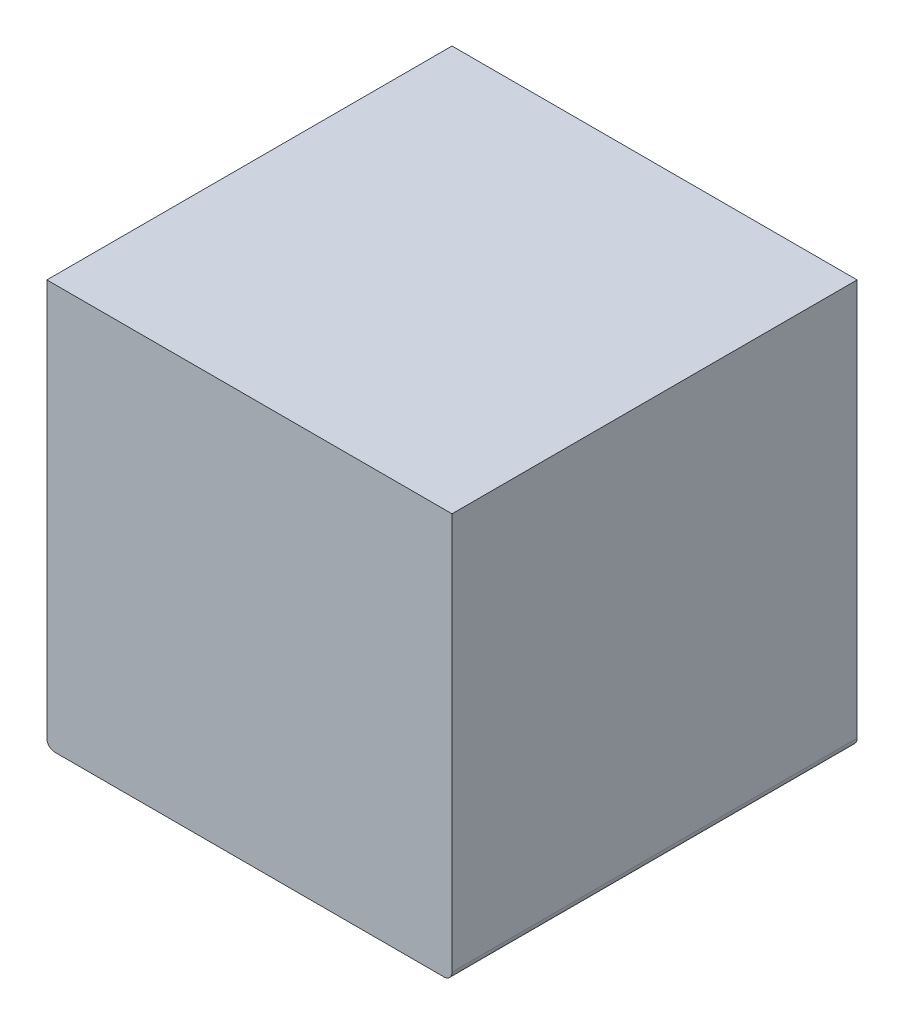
ISO-10303-21;
HEADER;
FILE_DESCRIPTION(('STEP AP214'),'2;1');
FILE_NAME('part.step','',(''),(''),'','','');
FILE_SCHEMA(('AUTOMOTIVE_DESIGN { 1 0 10303 214 1 1 1 1 }'));
ENDSEC;
DATA;
#1=APPLICATION_CONTEXT('core data for automotive mechanical design processes');
#2=APPLICATION_PROTOCOL_DEFINITION('international standard','automotive_design',2000,#1);
#3=PRODUCT_CONTEXT('',#1,'mechanical');
#4=PRODUCT('Part','Part','',(#3));
#5=PRODUCT_RELATED_PRODUCT_CATEGORY('part','',(#4));
#6=PRODUCT_DEFINITION_FORMATION('','',#4);
#7=PRODUCT_DEFINITION_CONTEXT('part definition',#1,'design');
#8=PRODUCT_DEFINITION('design','',#6,#7);
#9=PRODUCT_DEFINITION_SHAPE('','',#8);
#10=(LENGTH_UNIT() NAMED_UNIT(*) SI_UNIT(.MILLI.,.METRE.));
#11=(NAMED_UNIT(*) PLANE_ANGLE_UNIT() SI_UNIT($,.RADIAN.));
#12=(NAMED_UNIT(*) SI_UNIT($,.STERADIAN.) SOLID_ANGLE_UNIT());
#13=UNCERTAINTY_MEASURE_WITH_UNIT(LENGTH_MEASURE(1.E-05),#10,'distance_accuracy_value','');
#14=(GEOMETRIC_REPRESENTATION_CONTEXT(3) GLOBAL_UNCERTAINTY_ASSIGNED_CONTEXT((#13)) GLOBAL_UNIT_ASSIGNED_CONTEXT((#10,
#11,#12)) REPRESENTATION_CONTEXT('',''));
#15=CARTESIAN_POINT('',(0.,0.,0.));
#16=DIRECTION('',(0.,0.,1.));
#17=DIRECTION('',(1.,0.,0.));
#18=AXIS2_PLACEMENT_3D('',#15,#16,#17);
#19=CARTESIAN_POINT('',(-50.,100.,50.));
#20=DIRECTION('',(1.,0.,0.));
#21=DIRECTION('',(0.,0.,-1.));
#22=AXIS2_PLACEMENT_3D('',#19,#20,#21);
#23=PLANE('',#22);
#24=DIRECTION('',(0.,-1.,0.));
#25=VECTOR('',#24,1.);
#26=CARTESIAN_POINT('',(-50.,100.,-50.));
#27=LINE('',#26,#25);
#28=CARTESIAN_POINT('',(-50.,100.,-50.));
#29=VERTEX_POINT('',#28);
#30=CARTESIAN_POINT('',(-50.,2.,-50.));
#31=VERTEX_POINT('',#30);
#32=EDGE_CURVE('E140',#29,#31,#27,.T.);
#33=ORIENTED_EDGE('',*,*,#32,.T.);
#34=DIRECTION('',(0.,0.,1.));
#35=VECTOR('',#34,1.);
#36=CARTESIAN_POINT('',(-50.,2.,50.));
#37=LINE('',#36,#35);
#38=CARTESIAN_POINT('',(-50.,2.,50.));
#39=VERTEX_POINT('',#38);
#40=EDGE_CURVE('E121',#31,#39,#37,.T.);
#41=ORIENTED_EDGE('',*,*,#40,.T.);
#42=DIRECTION('',(0.,-1.,0.));
#43=VECTOR('',#42,1.);
#44=CARTESIAN_POINT('',(-50.,100.,50.));
#45=LINE('',#44,#43);
#46=CARTESIAN_POINT('',(-50.,100.,50.));
#47=VERTEX_POINT('',#46);
#48=EDGE_CURVE('E102',#47,#39,#45,.T.);
#49=ORIENTED_EDGE('',*,*,#48,.F.);
#50=DIRECTION('',(0.,0.,1.));
#51=VECTOR('',#50,1.);
#52=CARTESIAN_POINT('',(-50.,100.,50.));
#53=LINE('',#52,#51);
#54=EDGE_CURVE('E108',#29,#47,#53,.T.);
#55=ORIENTED_EDGE('',*,*,#54,.F.);
#56=EDGE_LOOP('',(#33,#41,#49,#55));
#57=FACE_BOUND('',#56,.T.);
#58=ADVANCED_FACE('F41',(#57),#23,.F.);
#59=CARTESIAN_POINT('',(50.,100.,50.));
#60=DIRECTION('',(0.,0.,-1.));
#61=DIRECTION('',(-1.,0.,0.));
#62=AXIS2_PLACEMENT_3D('',#59,#60,#61);
#63=PLANE('',#62);
#64=ORIENTED_EDGE('',*,*,#48,.T.);
#65=CARTESIAN_POINT('',(-48.,2.,50.));
#66=DIRECTION('',(0.,0.,-1.));
#67=DIRECTION('',(-1.,0.,0.));
#68=AXIS2_PLACEMENT_3D('',#65,#66,#67);
#69=CIRCLE('',#68,2.);
#70=CARTESIAN_POINT('',(-48.,0.,50.));
#71=VERTEX_POINT('',#70);
#72=EDGE_CURVE('E131',#39,#71,#69,.F.);
#73=ORIENTED_EDGE('',*,*,#72,.T.);
#74=DIRECTION('',(1.,0.,0.));
#75=VECTOR('',#74,1.);
#76=CARTESIAN_POINT('',(50.,0.,50.));
#77=LINE('',#76,#75);
#78=CARTESIAN_POINT('',(48.,0.,50.));
#79=VERTEX_POINT('',#78);
#80=EDGE_CURVE('E145',#71,#79,#77,.T.);
#81=ORIENTED_EDGE('',*,*,#80,.T.);
#82=CARTESIAN_POINT('',(48.,2.,50.));
#83=DIRECTION('',(0.,0.,-1.));
#84=DIRECTION('',(-1.,0.,0.));
#85=AXIS2_PLACEMENT_3D('',#82,#83,#84);
#86=CIRCLE('',#85,2.);
#87=CARTESIAN_POINT('',(50.,2.,50.));
#88=VERTEX_POINT('',#87);
#89=EDGE_CURVE('E123',#79,#88,#86,.F.);
#90=ORIENTED_EDGE('',*,*,#89,.T.);
#91=DIRECTION('',(0.,-1.,0.));
#92=VECTOR('',#91,1.);
#93=CARTESIAN_POINT('',(50.,100.,50.));
#94=LINE('',#93,#92);
#95=CARTESIAN_POINT('',(50.,100.,50.));
#96=VERTEX_POINT('',#95);
#97=EDGE_CURVE('E104',#96,#88,#94,.T.);
#98=ORIENTED_EDGE('',*,*,#97,.F.);
#99=DIRECTION('',(1.,0.,0.));
#100=VECTOR('',#99,1.);
#101=CARTESIAN_POINT('',(50.,100.,50.));
#102=LINE('',#101,#100);
#103=EDGE_CURVE('E98',#47,#96,#102,.T.);
#104=ORIENTED_EDGE('',*,*,#103,.F.);
#105=EDGE_LOOP('',(#64,#73,#81,#90,#98,#104));
#106=FACE_BOUND('',#105,.T.);
#107=ADVANCED_FACE('F100',(#106),#63,.F.);
#108=CARTESIAN_POINT('',(50.,100.,50.));
#109=DIRECTION('',(-1.,0.,0.));
#110=DIRECTION('',(0.,0.,1.));
#111=AXIS2_PLACEMENT_3D('',#108,#109,#110);
#112=PLANE('',#111);
#113=ORIENTED_EDGE('',*,*,#97,.T.);
#114=DIRECTION('',(0.,0.,-1.));
#115=VECTOR('',#114,1.);
#116=CARTESIAN_POINT('',(50.,2.,50.));
#117=LINE('',#116,#115);
#118=CARTESIAN_POINT('',(50.,2.,-50.));
#119=VERTEX_POINT('',#118);
#120=EDGE_CURVE('E11',#88,#119,#117,.T.);
#121=ORIENTED_EDGE('',*,*,#120,.T.);
#122=DIRECTION('',(0.,-1.,0.));
#123=VECTOR('',#122,1.);
#124=CARTESIAN_POINT('',(50.,100.,-50.));
#125=LINE('',#124,#123);
#126=CARTESIAN_POINT('',(50.,100.,-50.));
#127=VERTEX_POINT('',#126);
#128=EDGE_CURVE('E126',#127,#119,#125,.T.);
#129=ORIENTED_EDGE('',*,*,#128,.F.);
#130=DIRECTION('',(0.,0.,-1.));
#131=VECTOR('',#130,1.);
#132=CARTESIAN_POINT('',(50.,100.,50.));
#133=LINE('',#132,#131);
#134=EDGE_CURVE('E107',#96,#127,#133,.T.);
#135=ORIENTED_EDGE('',*,*,#134,.F.);
#136=EDGE_LOOP('',(#113,#121,#129,#135));
#137=FACE_BOUND('',#136,.T.);
#138=ADVANCED_FACE('F156',(#137),#112,.F.);
#139=CARTESIAN_POINT('',(50.,100.,-50.));
#140=DIRECTION('',(0.,0.,1.));
#141=DIRECTION('',(1.,0.,0.));
#142=AXIS2_PLACEMENT_3D('',#139,#140,#141);
#143=PLANE('',#142);
#144=DIRECTION('',(-1.,0.,0.));
#145=VECTOR('',#144,1.);
#146=CARTESIAN_POINT('',(50.,0.,-50.));
#147=LINE('',#146,#145);
#148=CARTESIAN_POINT('',(48.,0.,-50.));
#149=VERTEX_POINT('',#148);
#150=CARTESIAN_POINT('',(-48.,0.,-50.));
#151=VERTEX_POINT('',#150);
#152=EDGE_CURVE('E117',#149,#151,#147,.T.);
#153=ORIENTED_EDGE('',*,*,#152,.T.);
#154=CARTESIAN_POINT('',(-48.,2.,-50.));
#155=DIRECTION('',(0.,0.,1.));
#156=DIRECTION('',(1.,0.,0.));
#157=AXIS2_PLACEMENT_3D('',#154,#155,#156);
#158=CIRCLE('',#157,2.);
#159=EDGE_CURVE('E50',#151,#31,#158,.F.);
#160=ORIENTED_EDGE('',*,*,#159,.T.);
#161=ORIENTED_EDGE('',*,*,#32,.F.);
#162=DIRECTION('',(-1.,0.,0.));
#163=VECTOR('',#162,1.);
#164=CARTESIAN_POINT('',(50.,100.,-50.));
#165=LINE('',#164,#163);
#166=EDGE_CURVE('E113',#127,#29,#165,.T.);
#167=ORIENTED_EDGE('',*,*,#166,.F.);
#168=ORIENTED_EDGE('',*,*,#128,.T.);
#169=CARTESIAN_POINT('',(48.,2.,-50.));
#170=DIRECTION('',(0.,0.,1.));
#171=DIRECTION('',(1.,0.,0.));
#172=AXIS2_PLACEMENT_3D('',#169,#170,#171);
#173=CIRCLE('',#172,2.);
#174=EDGE_CURVE('E58',#119,#149,#173,.F.);
#175=ORIENTED_EDGE('',*,*,#174,.T.);
#176=EDGE_LOOP('',(#153,#160,#161,#167,#168,#175));
#177=FACE_BOUND('',#176,.T.);
#178=ADVANCED_FACE('F139',(#177),#143,.F.);
#179=CARTESIAN_POINT('',(0.,100.,0.));
#180=DIRECTION('',(0.,1.,0.));
#181=DIRECTION('',(0.,0.,1.));
#182=AXIS2_PLACEMENT_3D('',#179,#180,#181);
#183=PLANE('',#182);
#184=ORIENTED_EDGE('',*,*,#54,.T.);
#185=ORIENTED_EDGE('',*,*,#103,.T.);
#186=ORIENTED_EDGE('',*,*,#134,.T.);
#187=ORIENTED_EDGE('',*,*,#166,.T.);
#188=EDGE_LOOP('',(#184,#185,#186,#187));
#189=FACE_BOUND('',#188,.T.);
#190=ADVANCED_FACE('F111',(#189),#183,.T.);
#191=CARTESIAN_POINT('',(0.,0.,0.));
#192=DIRECTION('',(0.,1.,0.));
#193=DIRECTION('',(0.,0.,1.));
#194=AXIS2_PLACEMENT_3D('',#191,#192,#193);
#195=PLANE('',#194);
#196=ORIENTED_EDGE('',*,*,#80,.F.);
#197=DIRECTION('',(0.,0.,1.));
#198=VECTOR('',#197,1.);
#199=CARTESIAN_POINT('',(-48.,0.,0.));
#200=LINE('',#199,#198);
#201=EDGE_CURVE('E65',#71,#151,#200,.F.);
#202=ORIENTED_EDGE('',*,*,#201,.T.);
#203=ORIENTED_EDGE('',*,*,#152,.F.);
#204=DIRECTION('',(0.,0.,-1.));
#205=VECTOR('',#204,1.);
#206=CARTESIAN_POINT('',(48.,0.,0.));
#207=LINE('',#206,#205);
#208=EDGE_CURVE('E133',#149,#79,#207,.F.);
#209=ORIENTED_EDGE('',*,*,#208,.T.);
#210=EDGE_LOOP('',(#196,#202,#203,#209));
#211=FACE_BOUND('',#210,.T.);
#212=ADVANCED_FACE('F147',(#211),#195,.F.);
#213=CARTESIAN_POINT('',(-48.,2.,50.));
#214=DIRECTION('',(0.,0.,1.));
#215=DIRECTION('',(1.,0.,0.));
#216=AXIS2_PLACEMENT_3D('',#213,#214,#215);
#217=CYLINDRICAL_SURFACE('',#216,2.);
#218=ORIENTED_EDGE('',*,*,#159,.F.);
#219=ORIENTED_EDGE('',*,*,#201,.F.);
#220=ORIENTED_EDGE('',*,*,#72,.F.);
#221=ORIENTED_EDGE('',*,*,#40,.F.);
#222=EDGE_LOOP('',(#218,#219,#220,#221));
#223=FACE_BOUND('',#222,.T.);
#224=ADVANCED_FACE('F143',(#223),#217,.T.);
#225=CARTESIAN_POINT('',(48.,2.,50.));
#226=DIRECTION('',(0.,0.,-1.));
#227=DIRECTION('',(-1.,0.,0.));
#228=AXIS2_PLACEMENT_3D('',#225,#226,#227);
#229=CYLINDRICAL_SURFACE('',#228,2.);
#230=ORIENTED_EDGE('',*,*,#89,.F.);
#231=ORIENTED_EDGE('',*,*,#208,.F.);
#232=ORIENTED_EDGE('',*,*,#174,.F.);
#233=ORIENTED_EDGE('',*,*,#120,.F.);
#234=EDGE_LOOP('',(#230,#231,#232,#233));
#235=FACE_BOUND('',#234,.T.);
#236=ADVANCED_FACE('F43',(#235),#229,.T.);
#237=CLOSED_SHELL('',(#58,#107,#138,#178,#190,#212,#224,#236));
#238=MANIFOLD_SOLID_BREP('B2',#237);
#239=ADVANCED_BREP_SHAPE_REPRESENTATION('',(#18,#238),#14);
#240=SHAPE_DEFINITION_REPRESENTATION(#9,#239);
ENDSEC;
END-ISO-10303-21;
